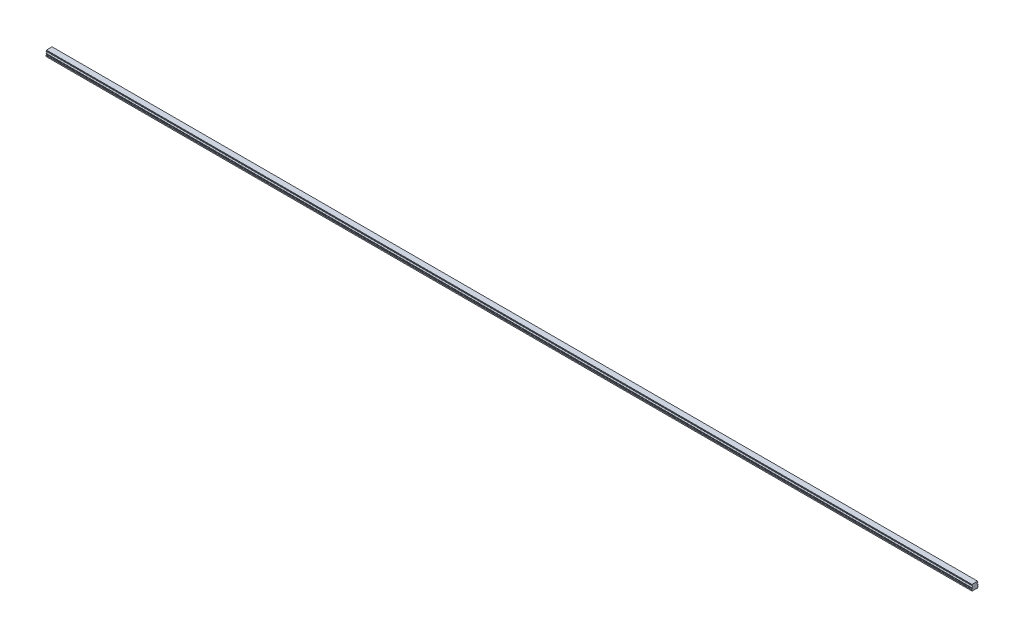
from build123d import *

# Parameters (mm, degrees)
BOSS_EXTRUDE1_DEPTH        = 2160
SKETCH3_R                  = 2.5
SKETCH3_R_2                = 2.1
CUT_EXTRUDE3_DEPTH         = 7
SKETCH3_2_R                = 2.1
CUT_EXTRUDE4_DEPTH         = 9.5
CHAMFER1_SIZE              = 0.4
LPATTERN2_COUNT            = 36
LPATTERN2_PITCH            = 60
CHAMFER1_OF_LPATTERN2_SIZE = 0.4


with BuildPart() as part:
    # Sketch1 → Boss-Extrude1 (new body)
    with BuildSketch(Plane(origin=(0, 0, 0), x_dir=(0, 0, -1), z_dir=(1, 0, 0))):
        with BuildLine():
            Line((6.59, 14), (-6.59, 14))
            Line((-6.59, 14), (-6.59, 13.15))
            Line((-6.59, 13.15), (-6.96, 12.356532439))
            Line((-6.96, 12.356532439), (-6.96, 11.435174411))
            ThreePointArc((-6.96, 11.435174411), (-5.25, 9.5), (-6.96, 7.564825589))
            Line((-6.96, 7.564825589), (-6.96, 6.643467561))
            Line((-6.96, 6.643467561), (-6.59, 5.85))
            Line((-6.59, 5.85), (-7.032116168, 4.2))
            Line((-7.032116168, 4.2), (-7.5, 3.929867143))
            Line((-7.5, 3.929867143), (-7.5, 1.4))
            Line((-7.5, 1.4), (-6.1, 0))
            Line((-6.1, 0), (-3.65, 0))
            Line((-3.65, 0), (-3.25, 0.4))
            Line((-3.25, 0.4), (3.25, 0.4))
            Line((3.25, 0.4), (3.65, 0))
            Line((3.65, 0), (6.1, 0))
            Line((6.1, 0), (7.5, 1.4))
            Line((7.5, 1.4), (7.5, 3.929867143))
            Line((7.5, 3.929867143), (7.032116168, 4.2))
            Line((7.032116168, 4.2), (6.59, 5.85))
            Line((6.59, 5.85), (6.96, 6.643467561))
            Line((6.96, 6.643467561), (6.96, 7.564825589))
            ThreePointArc((6.96, 7.564825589), (5.25, 9.5), (6.96, 11.435174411))
            Line((6.96, 11.435174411), (6.96, 12.356532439))
            Line((6.96, 12.356532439), (6.59, 13.15))
            Line((6.59, 13.15), (6.59, 14))
        make_face()
    extrude(amount=BOSS_EXTRUDE1_DEPTH)

    # Sketch3 → Cut-Extrude3 (cut)
    with BuildSketch(Plane.XZ):
        with Locations(Location((30, 0, 0), (0, 0, 270))):
            Circle(SKETCH3_R)
        with Locations(Location((30, 0, 0), (0, 0, 270))):
            Circle(SKETCH3_R_2, mode=Mode.SUBTRACT)
    cut_extrude3 = extrude(amount=-CUT_EXTRUDE3_DEPTH, mode=Mode.SUBTRACT)

    # Sketch3_2 → Cut-Extrude4 (cut)
    with BuildSketch(Plane.XZ):
        with Locations(Location((30, 0, 0), (0, 0, 270))):
            Circle(SKETCH3_2_R)
    cut_extrude4 = extrude(amount=-CUT_EXTRUDE4_DEPTH, mode=Mode.SUBTRACT)

    # Cut-Extrude5 cone 1 section (on through the dimple's axis) → Cut-Extrude5 (revolve, cut)
    with BuildSketch(Plane(origin=(30, 9.5, 0), x_dir=(0, 0, -1), z_dir=(1, 0, 0))):
        Polygon((0, 0), (2.1, 0), (0, 1.212435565), align=None)
    revolve(axis=Axis((30, 9.5, 0), (0, 1, 0)), mode=Mode.SUBTRACT)

    # Chamfer1
    chamfer1_edges = [part.edges().sort_by_distance(p)[0] for p in [
        (30, 0.4, 2.5),
    ]]
    chamfer(chamfer1_edges, length=CHAMFER1_SIZE)

    # LPattern2: Cut-Extrude3, Cut-Extrude4 ×36
    with Locations(*[(i * LPATTERN2_PITCH, 0, 0) for i in range(1, LPATTERN2_COUNT)]):
        add(cut_extrude3, mode=Mode.SUBTRACT)
        add(cut_extrude4, mode=Mode.SUBTRACT)

    # Chamfer1 of LPattern2
    chamfer1_of_lpattern2_edges = [part.edges().sort_by_distance(p)[0] for p in [
        (90, 0.4, 2.5),
        (150, 0.4, 2.5),
        (210, 0.4, 2.5),
        (270, 0.4, 2.5),
        (330, 0.4, 2.5),
        (390, 0.4, 2.5),
        (450, 0.4, 2.5),
        (510, 0.4, 2.5),
        (570, 0.4, 2.5),
        (630, 0.4, 2.5),
        (690, 0.4, 2.5),
        (750, 0.4, 2.5),
        (810, 0.4, 2.5),
        (870, 0.4, 2.5),
        (930, 0.4, 2.5),
        (990, 0.4, 2.5),
        (1050, 0.4, 2.5),
        (1110, 0.4, 2.5),
        (1170, 0.4, 2.5),
        (1230, 0.4, 2.5),
        (1290, 0.4, 2.5),
        (1350, 0.4, 2.5),
        (1410, 0.4, 2.5),
        (1470, 0.4, 2.5),
        (1530, 0.4, 2.5),
        (1590, 0.4, 2.5),
        (1650, 0.4, 2.5),
        (1710, 0.4, 2.5),
        (1770, 0.4, 2.5),
        (1830, 0.4, 2.5),
        (1890, 0.4, 2.5),
        (1950, 0.4, 2.5),
        (2010, 0.4, 2.5),
        (2070, 0.4, 2.5),
        (2130, 0.4, 2.5),
    ]]
    chamfer(chamfer1_of_lpattern2_edges, length=CHAMFER1_OF_LPATTERN2_SIZE)


solid = part.part
